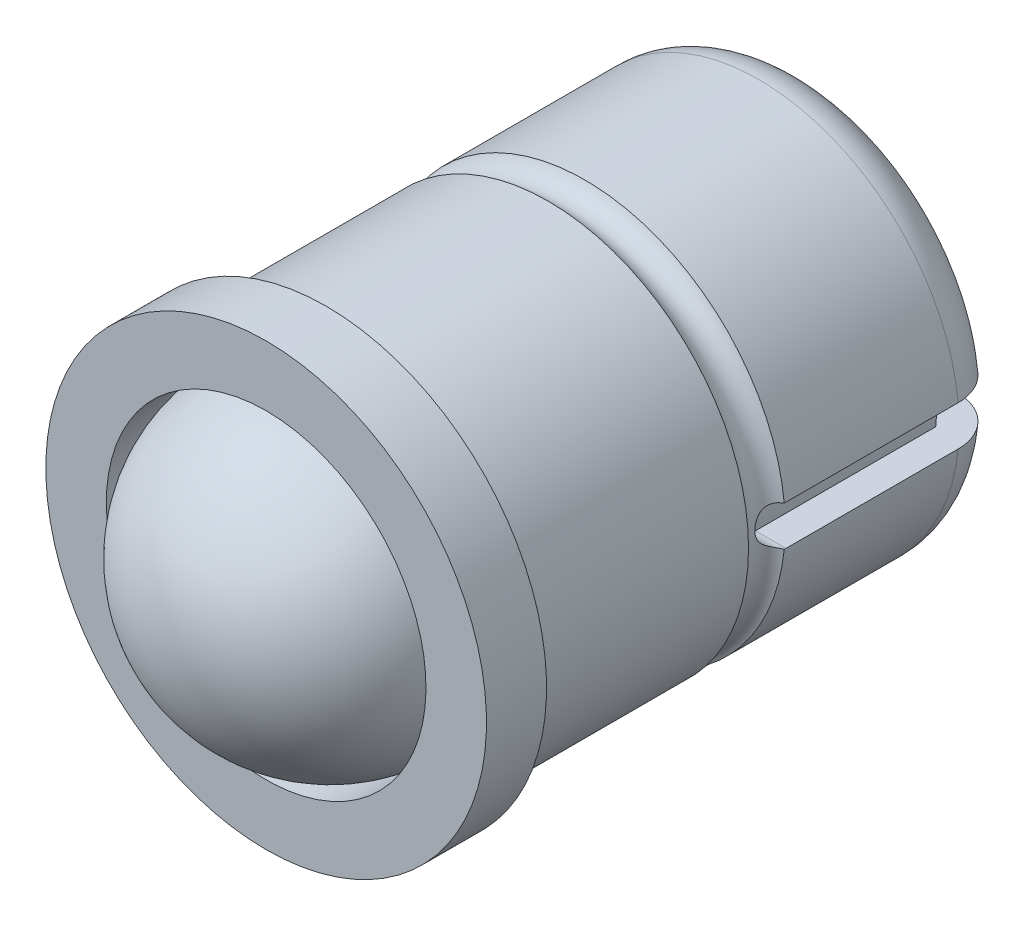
ISO-10303-21;
HEADER;
FILE_DESCRIPTION(('STEP AP214'),'2;1');
FILE_NAME('part.step','',(''),(''),'','','');
FILE_SCHEMA(('AUTOMOTIVE_DESIGN { 1 0 10303 214 1 1 1 1 }'));
ENDSEC;
DATA;
#1=APPLICATION_CONTEXT('core data for automotive mechanical design processes');
#2=APPLICATION_PROTOCOL_DEFINITION('international standard','automotive_design',2000,#1);
#3=PRODUCT_CONTEXT('',#1,'mechanical');
#4=PRODUCT('Part','Part','',(#3));
#5=PRODUCT_RELATED_PRODUCT_CATEGORY('part','',(#4));
#6=PRODUCT_DEFINITION_FORMATION('','',#4);
#7=PRODUCT_DEFINITION_CONTEXT('part definition',#1,'design');
#8=PRODUCT_DEFINITION('design','',#6,#7);
#9=PRODUCT_DEFINITION_SHAPE('','',#8);
#10=(LENGTH_UNIT() NAMED_UNIT(*) SI_UNIT(.MILLI.,.METRE.));
#11=(NAMED_UNIT(*) PLANE_ANGLE_UNIT() SI_UNIT($,.RADIAN.));
#12=(NAMED_UNIT(*) SI_UNIT($,.STERADIAN.) SOLID_ANGLE_UNIT());
#13=UNCERTAINTY_MEASURE_WITH_UNIT(LENGTH_MEASURE(1.E-05),#10,'distance_accuracy_value','');
#14=(GEOMETRIC_REPRESENTATION_CONTEXT(3) GLOBAL_UNCERTAINTY_ASSIGNED_CONTEXT((#13)) GLOBAL_UNIT_ASSIGNED_CONTEXT((#10,
#11,#12)) REPRESENTATION_CONTEXT('',''));
#15=CARTESIAN_POINT('',(0.,0.,0.));
#16=DIRECTION('',(0.,0.,1.));
#17=DIRECTION('',(1.,0.,0.));
#18=AXIS2_PLACEMENT_3D('',#15,#16,#17);
#19=CARTESIAN_POINT('',(0.,0.,1.5));
#20=DIRECTION('',(0.,0.,-1.));
#21=DIRECTION('',(0.,1.,0.));
#22=AXIS2_PLACEMENT_3D('',#19,#20,#21);
#23=CYLINDRICAL_SURFACE('',#22,3.99);
#24=CARTESIAN_POINT('',(0.,0.,1.5));
#25=DIRECTION('',(0.,0.,-1.));
#26=DIRECTION('',(0.,1.,0.));
#27=AXIS2_PLACEMENT_3D('',#24,#25,#26);
#28=CIRCLE('',#27,3.99);
#29=CARTESIAN_POINT('',(0.,3.99,1.5));
#30=VERTEX_POINT('',#29);
#31=EDGE_CURVE('E130',#30,#30,#28,.F.);
#32=ORIENTED_EDGE('',*,*,#31,.T.);
#33=EDGE_LOOP('',(#32));
#34=FACE_BOUND('',#33,.T.);
#35=CARTESIAN_POINT('',(0.,0.,0.182665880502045));
#36=DIRECTION('',(0.,0.,-1.));
#37=DIRECTION('',(0.,1.,0.));
#38=AXIS2_PLACEMENT_3D('',#35,#36,#37);
#39=CIRCLE('',#38,3.99);
#40=CARTESIAN_POINT('',(0.,3.99,0.182665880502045));
#41=VERTEX_POINT('',#40);
#42=EDGE_CURVE('E125',#41,#41,#39,.F.);
#43=ORIENTED_EDGE('',*,*,#42,.F.);
#44=EDGE_LOOP('',(#43));
#45=FACE_BOUND('',#44,.T.);
#46=ADVANCED_FACE('F14',(#34,#45),#23,.F.);
#47=CARTESIAN_POINT('',(5.5,0.,1.5));
#48=DIRECTION('',(0.,0.,-1.));
#49=DIRECTION('',(0.,1.,0.));
#50=AXIS2_PLACEMENT_3D('',#47,#48,#49);
#51=PLANE('',#50);
#52=CARTESIAN_POINT('',(0.,0.,1.5));
#53=DIRECTION('',(0.,0.,-1.));
#54=DIRECTION('',(0.,1.,0.));
#55=AXIS2_PLACEMENT_3D('',#52,#53,#54);
#56=CIRCLE('',#55,5.5);
#57=CARTESIAN_POINT('',(0.,5.5,1.5));
#58=VERTEX_POINT('',#57);
#59=EDGE_CURVE('E133',#58,#58,#56,.T.);
#60=ORIENTED_EDGE('',*,*,#59,.F.);
#61=EDGE_LOOP('',(#60));
#62=FACE_BOUND('',#61,.T.);
#63=ORIENTED_EDGE('',*,*,#31,.F.);
#64=EDGE_LOOP('',(#63));
#65=FACE_BOUND('',#64,.T.);
#66=ADVANCED_FACE('F16',(#62,#65),#51,.F.);
#67=CARTESIAN_POINT('',(0.,0.,1.5));
#68=DIRECTION('',(0.,0.,-1.));
#69=DIRECTION('',(0.,1.,0.));
#70=AXIS2_PLACEMENT_3D('',#67,#68,#69);
#71=CYLINDRICAL_SURFACE('',#70,5.5);
#72=CARTESIAN_POINT('',(0.,0.,0.));
#73=DIRECTION('',(0.,0.,-1.));
#74=DIRECTION('',(0.,1.,0.));
#75=AXIS2_PLACEMENT_3D('',#72,#73,#74);
#76=CIRCLE('',#75,5.5);
#77=CARTESIAN_POINT('',(0.,5.5,0.));
#78=VERTEX_POINT('',#77);
#79=EDGE_CURVE('E137',#78,#78,#76,.F.);
#80=ORIENTED_EDGE('',*,*,#79,.T.);
#81=EDGE_LOOP('',(#80));
#82=FACE_BOUND('',#81,.T.);
#83=ORIENTED_EDGE('',*,*,#59,.T.);
#84=EDGE_LOOP('',(#83));
#85=FACE_BOUND('',#84,.T.);
#86=ADVANCED_FACE('F395',(#82,#85),#71,.T.);
#87=CARTESIAN_POINT('',(5.,0.,0.));
#88=DIRECTION('',(0.,0.,1.));
#89=DIRECTION('',(0.,-1.,0.));
#90=AXIS2_PLACEMENT_3D('',#87,#88,#89);
#91=PLANE('',#90);
#92=CARTESIAN_POINT('',(0.,0.,0.));
#93=DIRECTION('',(0.,0.,-1.));
#94=DIRECTION('',(0.,1.,0.));
#95=AXIS2_PLACEMENT_3D('',#92,#93,#94);
#96=CIRCLE('',#95,5.);
#97=CARTESIAN_POINT('',(0.,5.,0.));
#98=VERTEX_POINT('',#97);
#99=EDGE_CURVE('E140',#98,#98,#96,.T.);
#100=ORIENTED_EDGE('',*,*,#99,.F.);
#101=EDGE_LOOP('',(#100));
#102=FACE_BOUND('',#101,.T.);
#103=ORIENTED_EDGE('',*,*,#79,.F.);
#104=EDGE_LOOP('',(#103));
#105=FACE_BOUND('',#104,.T.);
#106=ADVANCED_FACE('F426',(#102,#105),#91,.F.);
#107=CARTESIAN_POINT('',(0.,0.,1.5));
#108=DIRECTION('',(0.,0.,-1.));
#109=DIRECTION('',(0.,1.,0.));
#110=AXIS2_PLACEMENT_3D('',#107,#108,#109);
#111=CYLINDRICAL_SURFACE('',#110,5.);
#112=CARTESIAN_POINT('',(0.,0.,-5.54174243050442));
#113=DIRECTION('',(0.,0.,1.));
#114=DIRECTION('',(0.,-1.,0.));
#115=AXIS2_PLACEMENT_3D('',#112,#113,#114);
#116=CIRCLE('',#115,5.);
#117=CARTESIAN_POINT('',(0.,-5.,-5.54174243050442));
#118=VERTEX_POINT('',#117);
#119=EDGE_CURVE('E324',#118,#118,#116,.T.);
#120=ORIENTED_EDGE('',*,*,#119,.T.);
#121=EDGE_LOOP('',(#120));
#122=FACE_BOUND('',#121,.T.);
#123=ORIENTED_EDGE('',*,*,#99,.T.);
#124=EDGE_LOOP('',(#123));
#125=FACE_BOUND('',#124,.T.);
#126=ADVANCED_FACE('F421',(#122,#125),#111,.T.);
#127=CARTESIAN_POINT('',(5.5,0.,-6.5));
#128=DIRECTION('',(1.,0.,0.));
#129=DIRECTION('',(0.,1.,0.));
#130=AXIS2_PLACEMENT_3D('',#127,#128,#129);
#131=CYLINDRICAL_SURFACE('',#130,0.5);
#132=DIRECTION('',(1.,0.,0.));
#133=VECTOR('',#132,1.);
#134=CARTESIAN_POINT('',(5.5,0.5,-6.5));
#135=LINE('',#134,#133);
#136=CARTESIAN_POINT('',(-4.21385012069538,0.5,-6.5));
#137=VERTEX_POINT('',#136);
#138=CARTESIAN_POINT('',(-4.9749371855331,0.5,-6.5));
#139=VERTEX_POINT('',#138);
#140=EDGE_CURVE('E151',#137,#139,#135,.F.);
#141=ORIENTED_EDGE('',*,*,#140,.F.);
#142=CARTESIAN_POINT('',(-4.21385012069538,0.5,-6.5));
#143=CARTESIAN_POINT('',(-4.21385050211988,0.49999880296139,-6.47201957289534));
#144=CARTESIAN_POINT('',(-4.21413181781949,0.49764336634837,-6.44402134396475));
#145=CARTESIAN_POINT('',(-4.2152263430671,0.488283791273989,-6.3888031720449));
#146=CARTESIAN_POINT('',(-4.21604011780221,0.481274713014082,-6.36158408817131));
#147=CARTESIAN_POINT('',(-4.2181061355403,0.462816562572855,-6.30873172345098));
#148=CARTESIAN_POINT('',(-4.21935809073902,0.451370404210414,-6.28309741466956));
#149=CARTESIAN_POINT('',(-4.22215905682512,0.42436905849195,-6.23411858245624));
#150=CARTESIAN_POINT('',(-4.22370801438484,0.408814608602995,-6.21077364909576));
#151=CARTESIAN_POINT('',(-4.22693711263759,0.373955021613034,-6.16691475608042));
#152=CARTESIAN_POINT('',(-4.22861780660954,0.354633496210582,-6.14641386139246));
#153=CARTESIAN_POINT('',(-4.23191601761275,0.312823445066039,-6.1089377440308));
#154=CARTESIAN_POINT('',(-4.23353353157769,0.290334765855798,-6.09196269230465));
#155=CARTESIAN_POINT('',(-4.23652874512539,0.242747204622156,-6.06197370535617));
#156=CARTESIAN_POINT('',(-4.23790572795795,0.217640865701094,-6.04897152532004));
#157=CARTESIAN_POINT('',(-4.24025866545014,0.165582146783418,-6.02737262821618));
#158=CARTESIAN_POINT('',(-4.24123463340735,0.138629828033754,-6.01877576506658));
#159=CARTESIAN_POINT('',(-4.24267168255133,0.0837774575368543,-6.00627038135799));
#160=CARTESIAN_POINT('',(-4.24313514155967,0.0558824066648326,-6.00234020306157));
#161=CARTESIAN_POINT('',(-4.24350306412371,-0.000174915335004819,-5.99921266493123));
#162=CARTESIAN_POINT('',(-4.24340754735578,-0.0283371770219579,-6.00001513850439));
#163=CARTESIAN_POINT('',(-4.24267021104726,-0.0839822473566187,-6.00631269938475));
#164=CARTESIAN_POINT('',(-4.24203110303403,-0.11146773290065,-6.01178449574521));
#165=CARTESIAN_POINT('',(-4.24028145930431,-0.165127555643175,-6.02722900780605));
#166=CARTESIAN_POINT('',(-4.23917091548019,-0.191301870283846,-6.03720180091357));
#167=CARTESIAN_POINT('',(-4.2365985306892,-0.241668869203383,-6.06139022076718));
#168=CARTESIAN_POINT('',(-4.2351358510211,-0.265856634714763,-6.07561599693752));
#169=CARTESIAN_POINT('',(-4.23202298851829,-0.31151027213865,-6.10789918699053));
#170=CARTESIAN_POINT('',(-4.23037279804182,-0.332976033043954,-6.12595675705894));
#171=CARTESIAN_POINT('',(-4.22705791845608,-0.372713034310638,-6.16552156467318));
#172=CARTESIAN_POINT('',(-4.22539320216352,-0.390964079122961,-6.18704908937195));
#173=CARTESIAN_POINT('',(-4.22224681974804,-0.423596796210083,-6.23287282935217));
#174=CARTESIAN_POINT('',(-4.22076515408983,-0.437978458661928,-6.25716905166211));
#175=CARTESIAN_POINT('',(-4.21815261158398,-0.462464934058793,-6.30785773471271));
#176=CARTESIAN_POINT('',(-4.21702185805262,-0.472568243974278,-6.33425092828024));
#177=CARTESIAN_POINT('',(-4.21524162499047,-0.488193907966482,-6.38837551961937));
#178=CARTESIAN_POINT('',(-4.2145921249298,-0.493716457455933,-6.41610686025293));
#179=CARTESIAN_POINT('',(-4.21385163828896,-0.499997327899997,-6.47194252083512));
#180=CARTESIAN_POINT('',(-4.21375732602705,-0.500784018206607,-6.50004360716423));
#181=CARTESIAN_POINT('',(-4.21412910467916,-0.497645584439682,-6.55597717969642));
#182=CARTESIAN_POINT('',(-4.21459518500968,-0.49372054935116,-6.58380967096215));
#183=CARTESIAN_POINT('',(-4.21603220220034,-0.481293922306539,-6.63833169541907));
#184=CARTESIAN_POINT('',(-4.21700163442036,-0.472805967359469,-6.66502437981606));
#185=CARTESIAN_POINT('',(-4.21933490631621,-0.45150844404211,-6.71660747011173));
#186=CARTESIAN_POINT('',(-4.22069875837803,-0.438698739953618,-6.7414978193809));
#187=CARTESIAN_POINT('',(-4.22367519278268,-0.409051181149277,-6.78889834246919));
#188=CARTESIAN_POINT('',(-4.22528891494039,-0.392194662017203,-6.81139676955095));
#189=CARTESIAN_POINT('',(-4.22857964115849,-0.354958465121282,-6.85325517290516));
#190=CARTESIAN_POINT('',(-4.23025664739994,-0.334578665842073,-6.87261504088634));
#191=CARTESIAN_POINT('',(-4.23349514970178,-0.290750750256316,-6.90774586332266));
#192=CARTESIAN_POINT('',(-4.23505602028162,-0.267287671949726,-6.9234982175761));
#193=CARTESIAN_POINT('',(-4.23787711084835,-0.218032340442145,-6.95083837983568));
#194=CARTESIAN_POINT('',(-4.23913733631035,-0.192240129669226,-6.96242626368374));
#195=CARTESIAN_POINT('',(-4.24121235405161,-0.139121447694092,-6.98107758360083));
#196=CARTESIAN_POINT('',(-4.24202821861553,-0.111798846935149,-6.98815191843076));
#197=CARTESIAN_POINT('',(-4.2431270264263,-0.0563434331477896,-6.99761081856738));
#198=CARTESIAN_POINT('',(-4.24340999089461,-0.0282106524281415,-6.9999955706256));
#199=CARTESIAN_POINT('',(-4.24341104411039,0.0278845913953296,-7.00000439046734));
#200=CARTESIAN_POINT('',(-4.24313254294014,0.0558470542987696,-6.99765719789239));
#201=CARTESIAN_POINT('',(-4.24204871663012,0.110977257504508,-6.98832943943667));
#202=CARTESIAN_POINT('',(-4.24124339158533,0.138144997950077,-6.98134887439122));
#203=CARTESIAN_POINT('',(-4.23919603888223,0.190911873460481,-6.96296123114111));
#204=CARTESIAN_POINT('',(-4.23795413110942,0.216511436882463,-6.95155536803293));
#205=CARTESIAN_POINT('',(-4.23517141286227,0.265437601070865,-6.92464388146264));
#206=CARTESIAN_POINT('',(-4.23363060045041,0.28876418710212,-6.90913823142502));
#207=CARTESIAN_POINT('',(-4.23041107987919,0.332629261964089,-6.87436046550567));
#208=CARTESIAN_POINT('',(-4.22873162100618,0.353150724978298,-6.85506694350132));
#209=CARTESIAN_POINT('',(-4.22543022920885,0.390676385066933,-6.81330513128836));
#210=CARTESIAN_POINT('',(-4.22380831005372,0.407679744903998,-6.79083608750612));
#211=CARTESIAN_POINT('',(-4.22079968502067,0.437735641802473,-6.74327329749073));
#212=CARTESIAN_POINT('',(-4.21941380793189,0.45077437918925,-6.71817078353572));
#213=CARTESIAN_POINT('',(-4.21704392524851,0.472433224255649,-6.66613082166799));
#214=CARTESIAN_POINT('',(-4.21605947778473,0.481058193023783,-6.63919542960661));
#215=CARTESIAN_POINT('',(-4.21484582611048,0.491553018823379,-6.59343034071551));
#216=CARTESIAN_POINT('',(-4.21447426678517,0.494716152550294,-6.5748906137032));
#217=CARTESIAN_POINT('',(-4.21397628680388,0.498940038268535,-6.53756993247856));
#218=CARTESIAN_POINT('',(-4.21384986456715,0.50000080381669,-6.51878897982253));
#219=CARTESIAN_POINT('',(-4.21385012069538,0.5,-6.5));
#220=B_SPLINE_CURVE_WITH_KNOTS('',3,(#142,#143,#144,#145,#146,#147,#148,#149,#150,#151,#152,
#153,#154,#155,#156,#157,#158,#159,#160,#161,#162,#163,#164,#165,#166,#167,#168,#169,#170,#171,
#172,#173,#174,#175,#176,#177,#178,#179,#180,#181,#182,#183,#184,#185,#186,#187,#188,#189,#190,
#191,#192,#193,#194,#195,#196,#197,#198,#199,#200,#201,#202,#203,#204,#205,#206,#207,#208,#209,
#210,#211,#212,#213,#214,#215,#216,#217,#218,#219),.UNSPECIFIED.,.T.,.F.,(4,2,2,2,2,2,2,2,2,2,2,
2,2,2,2,2,2,2,2,2,2,2,2,2,2,2,2,2,2,2,2,2,2,2,2,2,2,2,4),(0.,0.0838726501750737,
0.167834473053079,0.251741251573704,0.335632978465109,0.419898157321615,0.504167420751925,
0.588683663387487,0.673197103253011,0.757316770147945,0.841433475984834,0.925133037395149,
1.00883403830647,1.09273640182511,1.17664218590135,1.26105761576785,1.34547325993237,
1.42991853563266,1.51436020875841,1.59829554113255,1.68222928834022,1.76591356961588,
1.84960047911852,1.93368103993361,2.01776450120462,2.10227219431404,2.1867783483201,
2.27107966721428,2.35537762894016,2.43916514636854,2.52295264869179,2.60671716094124,
2.69048221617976,2.77473502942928,2.85900787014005,2.94357076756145,3.02804033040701,
3.08436154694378,3.14068240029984),.UNSPECIFIED.);
#221=CARTESIAN_POINT('',(-4.21385012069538,-0.5,-6.5));
#222=VERTEX_POINT('',#221);
#223=EDGE_CURVE('E360',#137,#222,#220,.T.);
#224=ORIENTED_EDGE('',*,*,#223,.T.);
#225=DIRECTION('',(1.,0.,0.));
#226=VECTOR('',#225,1.);
#227=CARTESIAN_POINT('',(5.5,-0.5,-6.5));
#228=LINE('',#227,#226);
#229=CARTESIAN_POINT('',(-4.9749371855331,-0.5,-6.5));
#230=VERTEX_POINT('',#229);
#231=EDGE_CURVE('E143',#230,#222,#228,.T.);
#232=ORIENTED_EDGE('',*,*,#231,.F.);
#233=CARTESIAN_POINT('',(-4.97511230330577,-0.498254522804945,-6.45825756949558));
#234=CARTESIAN_POINT('',(-4.97505398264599,-0.498836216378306,-6.46520235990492));
#235=CARTESIAN_POINT('',(-4.97501022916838,-0.499272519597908,-6.47215329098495));
#236=CARTESIAN_POINT('',(-4.97495185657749,-0.499854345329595,-6.48606743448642));
#237=CARTESIAN_POINT('',(-4.97493723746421,-0.499999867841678,-6.49303064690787));
#238=CARTESIAN_POINT('',(-4.9749371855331,-0.5,-6.5));
#239=B_SPLINE_CURVE_WITH_KNOTS('',3,(#233,#234,#235,#236,#237,#238),.UNSPECIFIED.,.F.,.F.,(4,2,
4),(0.,0.0208942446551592,0.0417884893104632),.UNSPECIFIED.);
#240=CARTESIAN_POINT('',(-4.97511230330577,-0.498254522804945,-6.45825756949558));
#241=VERTEX_POINT('',#240);
#242=EDGE_CURVE('E295',#241,#230,#239,.T.);
#243=ORIENTED_EDGE('',*,*,#242,.F.);
#244=CARTESIAN_POINT('',(-4.97511230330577,-0.498254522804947,-6.45825756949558));
#245=CARTESIAN_POINT('',(-4.95347695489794,-0.497446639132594,-6.4488552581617));
#246=CARTESIAN_POINT('',(-4.93250433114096,-0.49627599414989,-6.43785192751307));
#247=CARTESIAN_POINT('',(-4.89232653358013,-0.49252672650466,-6.41291918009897));
#248=CARTESIAN_POINT('',(-4.87313419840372,-0.489938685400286,-6.3989705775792));
#249=CARTESIAN_POINT('',(-4.83717243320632,-0.482645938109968,-6.36848022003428));
#250=CARTESIAN_POINT('',(-4.82041612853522,-0.477930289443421,-6.35192535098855));
#251=CARTESIAN_POINT('',(-4.79012213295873,-0.465706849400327,-6.31709282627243));
#252=CARTESIAN_POINT('',(-4.77657185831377,-0.458210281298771,-6.2988223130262));
#253=CARTESIAN_POINT('',(-4.75417837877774,-0.440916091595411,-6.26348359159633));
#254=CARTESIAN_POINT('',(-4.74499994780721,-0.431423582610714,-6.24647788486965));
#255=CARTESIAN_POINT('',(-4.72945565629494,-0.409803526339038,-6.2128401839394));
#256=CARTESIAN_POINT('',(-4.72309252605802,-0.39767343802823,-6.19620856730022));
#257=CARTESIAN_POINT('',(-4.71311286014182,-0.371719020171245,-6.1650141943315));
#258=CARTESIAN_POINT('',(-4.70936955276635,-0.358017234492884,-6.15038864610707));
#259=CARTESIAN_POINT('',(-4.70362880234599,-0.328736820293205,-6.12272149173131));
#260=CARTESIAN_POINT('',(-4.70163488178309,-0.313154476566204,-6.10968312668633));
#261=CARTESIAN_POINT('',(-4.69869950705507,-0.278218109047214,-6.08391366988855));
#262=CARTESIAN_POINT('',(-4.69793877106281,-0.258639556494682,-6.07146722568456));
#263=CARTESIAN_POINT('',(-4.69731348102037,-0.217964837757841,-6.04941489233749));
#264=CARTESIAN_POINT('',(-4.69744824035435,-0.196869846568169,-6.03980683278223));
#265=CARTESIAN_POINT('',(-4.69807948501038,-0.149990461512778,-6.02226878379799));
#266=CARTESIAN_POINT('',(-4.69863175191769,-0.124004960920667,-6.01487367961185));
#267=CARTESIAN_POINT('',(-4.69952658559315,-0.0711812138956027,-6.0043601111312));
#268=CARTESIAN_POINT('',(-4.69986913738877,-0.0443429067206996,-6.00124195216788));
#269=CARTESIAN_POINT('',(-4.70007065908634,0.0106428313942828,-5.99932541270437));
#270=CARTESIAN_POINT('',(-4.69990835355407,0.0387972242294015,-6.00071718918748));
#271=CARTESIAN_POINT('',(-4.69918655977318,0.0944805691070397,-6.00820409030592));
#272=CARTESIAN_POINT('',(-4.69862686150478,0.122009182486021,-6.01430170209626));
#273=CARTESIAN_POINT('',(-4.6976876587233,0.175640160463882,-6.03102302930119));
#274=CARTESIAN_POINT('',(-4.69730804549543,0.201743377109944,-6.04164400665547));
#275=CARTESIAN_POINT('',(-4.69768343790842,0.25178972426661,-6.06711655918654));
#276=CARTESIAN_POINT('',(-4.69843754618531,0.275734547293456,-6.08196478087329));
#277=CARTESIAN_POINT('',(-4.70194798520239,0.316333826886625,-6.11212949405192));
#278=CARTESIAN_POINT('',(-4.70428927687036,0.333502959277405,-6.12680112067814));
#279=CARTESIAN_POINT('',(-4.71123230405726,0.365479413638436,-6.15805997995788));
#280=CARTESIAN_POINT('',(-4.71583170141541,0.380289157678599,-6.17464521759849));
#281=CARTESIAN_POINT('',(-4.72794667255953,0.407254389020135,-6.20909576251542));
#282=CARTESIAN_POINT('',(-4.73548198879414,0.419391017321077,-6.22696905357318));
#283=CARTESIAN_POINT('',(-4.75378669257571,0.44066382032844,-6.26282934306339));
#284=CARTESIAN_POINT('',(-4.76455322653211,0.449802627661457,-6.28081622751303));
#285=CARTESIAN_POINT('',(-4.78786399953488,0.464391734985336,-6.3139028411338));
#286=CARTESIAN_POINT('',(-4.80008573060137,0.470135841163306,-6.32910336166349));
#287=CARTESIAN_POINT('',(-4.82675047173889,0.479700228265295,-6.35814842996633));
#288=CARTESIAN_POINT('',(-4.84119847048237,0.483516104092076,-6.37198981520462));
#289=CARTESIAN_POINT('',(-4.87430620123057,0.490108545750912,-6.39984380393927));
#290=CARTESIAN_POINT('',(-4.89327161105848,0.492632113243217,-6.41354998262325));
#291=CARTESIAN_POINT('',(-4.9329860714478,0.496303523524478,-6.43810463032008));
#292=CARTESIAN_POINT('',(-4.95372717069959,0.497457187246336,-6.44896503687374));
#293=CARTESIAN_POINT('',(-4.97511230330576,0.49825452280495,-6.45825756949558));
#294=B_SPLINE_CURVE_WITH_KNOTS('',3,(#244,#245,#246,#247,#248,#249,#250,#251,#252,#253,#254,
#255,#256,#257,#258,#259,#260,#261,#262,#263,#264,#265,#266,#267,#268,#269,#270,#271,#272,#273,
#274,#275,#276,#277,#278,#279,#280,#281,#282,#283,#284,#285,#286,#287,#288,#289,#290,#291,#292,
#293),.UNSPECIFIED.,.F.,.F.,(4,2,2,2,2,2,2,2,2,2,2,2,2,2,2,2,2,2,2,2,2,2,2,2,4),(0.,
0.0708172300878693,0.142110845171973,0.213775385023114,0.285153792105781,0.349393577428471,
0.413695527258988,0.47461810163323,0.53566306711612,0.605037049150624,0.674357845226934,
0.755065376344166,0.835778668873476,0.919938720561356,1.00414328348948,1.08829694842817,
1.17238403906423,1.24022324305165,1.30799235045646,1.37622525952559,1.44439808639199,
1.50512651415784,1.56599305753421,1.63630018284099,1.70630748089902),.UNSPECIFIED.);
#295=CARTESIAN_POINT('',(-4.97511230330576,0.498254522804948,-6.45825756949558));
#296=VERTEX_POINT('',#295);
#297=EDGE_CURVE('E318',#241,#296,#294,.T.);
#298=ORIENTED_EDGE('',*,*,#297,.T.);
#299=CARTESIAN_POINT('',(-4.9749371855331,0.5,-6.5));
#300=CARTESIAN_POINT('',(-4.97493723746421,0.499999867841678,-6.49303064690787));
#301=CARTESIAN_POINT('',(-4.97495185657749,0.499854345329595,-6.48606743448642));
#302=CARTESIAN_POINT('',(-4.97501022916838,0.499272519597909,-6.47215329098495));
#303=CARTESIAN_POINT('',(-4.97505398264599,0.498836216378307,-6.46520235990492));
#304=CARTESIAN_POINT('',(-4.97511230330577,0.498254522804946,-6.45825756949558));
#305=B_SPLINE_CURVE_WITH_KNOTS('',3,(#299,#300,#301,#302,#303,#304),.UNSPECIFIED.,.F.,.F.,(4,2,
4),(0.,0.0208942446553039,0.0417884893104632),.UNSPECIFIED.);
#306=EDGE_CURVE('E113',#139,#296,#305,.T.);
#307=ORIENTED_EDGE('',*,*,#306,.F.);
#308=EDGE_LOOP('',(#141,#224,#232,#243,#298,#307));
#309=FACE_BOUND('',#308,.T.);
#310=ADVANCED_FACE('F159',(#309),#131,.F.);
#311=CARTESIAN_POINT('',(5.5,0.,-6.5));
#312=DIRECTION('',(1.,0.,0.));
#313=DIRECTION('',(0.,1.,0.));
#314=AXIS2_PLACEMENT_3D('',#311,#312,#313);
#315=CYLINDRICAL_SURFACE('',#314,0.5);
#316=DIRECTION('',(1.,0.,0.));
#317=VECTOR('',#316,1.);
#318=CARTESIAN_POINT('',(5.5,-0.5,-6.5));
#319=LINE('',#318,#317);
#320=CARTESIAN_POINT('',(4.21385012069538,-0.5,-6.5));
#321=VERTEX_POINT('',#320);
#322=CARTESIAN_POINT('',(4.9749371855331,-0.5,-6.5));
#323=VERTEX_POINT('',#322);
#324=EDGE_CURVE('E112',#321,#323,#319,.T.);
#325=ORIENTED_EDGE('',*,*,#324,.F.);
#326=CARTESIAN_POINT('',(4.21385012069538,-0.5,-6.5));
#327=CARTESIAN_POINT('',(4.21383926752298,-0.500024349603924,-6.47197459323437));
#328=CARTESIAN_POINT('',(4.2141294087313,-0.49764523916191,-6.44395853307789));
#329=CARTESIAN_POINT('',(4.21523104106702,-0.488262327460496,-6.38875044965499));
#330=CARTESIAN_POINT('',(4.21604199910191,-0.481263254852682,-6.36155761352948));
#331=CARTESIAN_POINT('',(4.2181052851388,-0.462818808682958,-6.3087318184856));
#332=CARTESIAN_POINT('',(4.21935776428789,-0.451371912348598,-6.28309939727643));
#333=CARTESIAN_POINT('',(4.22215913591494,-0.424369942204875,-6.23412093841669));
#334=CARTESIAN_POINT('',(4.22370800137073,-0.408815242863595,-6.21077469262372));
#335=CARTESIAN_POINT('',(4.22693697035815,-0.373956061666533,-6.16691581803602));
#336=CARTESIAN_POINT('',(4.22861761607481,-0.354635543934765,-6.14641597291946));
#337=CARTESIAN_POINT('',(4.23191586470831,-0.312825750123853,-6.10893953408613));
#338=CARTESIAN_POINT('',(4.23353345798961,-0.290335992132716,-6.09196347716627));
#339=CARTESIAN_POINT('',(4.23652878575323,-0.242746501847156,-6.06197325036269));
#340=CARTESIAN_POINT('',(4.23790580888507,-0.217639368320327,-6.0489707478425));
#341=CARTESIAN_POINT('',(4.24025872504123,-0.165580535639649,-6.0273721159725));
#342=CARTESIAN_POINT('',(4.24123465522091,-0.13862900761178,-6.01877557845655));
#343=CARTESIAN_POINT('',(4.24267167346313,-0.0837777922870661,-6.00627045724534));
#344=CARTESIAN_POINT('',(4.24313513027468,-0.0558830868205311,-6.00234029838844));
#345=CARTESIAN_POINT('',(4.24350306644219,0.00017422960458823,-5.99921264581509));
#346=CARTESIAN_POINT('',(4.24340755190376,0.0283368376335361,-6.00001510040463));
#347=CARTESIAN_POINT('',(4.24267021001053,0.0839823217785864,-6.0063127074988));
#348=CARTESIAN_POINT('',(4.24203109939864,0.11146787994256,-6.01178452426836));
#349=CARTESIAN_POINT('',(4.2402814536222,0.16512769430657,-6.02722906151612));
#350=CARTESIAN_POINT('',(4.23917091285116,0.191301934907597,-6.03720183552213));
#351=CARTESIAN_POINT('',(4.23659850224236,0.241669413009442,-6.06139047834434));
#352=CARTESIAN_POINT('',(4.23513578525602,0.265857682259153,-6.07561659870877));
#353=CARTESIAN_POINT('',(4.23202292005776,0.311511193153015,-6.1078999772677));
#354=CARTESIAN_POINT('',(4.23037277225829,0.332976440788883,-6.12595722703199));
#355=CARTESIAN_POINT('',(4.22705815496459,0.372710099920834,-6.16551857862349));
#356=CARTESIAN_POINT('',(4.22539365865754,0.390958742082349,-6.18704253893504));
#357=CARTESIAN_POINT('',(4.22224729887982,0.423592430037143,-6.23286575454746));
#358=CARTESIAN_POINT('',(4.22076549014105,0.437976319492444,-6.25716583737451));
#359=CARTESIAN_POINT('',(4.21815150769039,0.462474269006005,-6.30787584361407));
#360=CARTESIAN_POINT('',(4.21701966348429,0.472584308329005,-6.33428772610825));
#361=CARTESIAN_POINT('',(4.21524119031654,0.488200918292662,-6.38841864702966));
#362=CARTESIAN_POINT('',(4.2145938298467,0.493714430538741,-6.41613564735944));
#363=CARTESIAN_POINT('',(4.21397326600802,0.498957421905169,-6.46266691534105));
#364=CARTESIAN_POINT('',(4.21384649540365,0.500009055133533,-6.48133786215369));
#365=CARTESIAN_POINT('',(4.21385012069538,0.5,-6.5));
#366=B_SPLINE_CURVE_WITH_KNOTS('',3,(#326,#327,#328,#329,#330,#331,#332,#333,#334,#335,#336,
#337,#338,#339,#340,#341,#342,#343,#344,#345,#346,#347,#348,#349,#350,#351,#352,#353,#354,#355,
#356,#357,#358,#359,#360,#361,#362,#363,#364,#365),.UNSPECIFIED.,.F.,.F.,(4,2,2,2,2,2,2,2,2,2,2,
2,2,2,2,2,2,2,2,4),(0.,0.0839601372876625,0.167834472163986,0.251737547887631,0.33563297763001,
0.419893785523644,0.504167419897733,0.588686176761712,0.673197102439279,0.757315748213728,
0.84143347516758,0.925133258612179,1.00883403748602,1.09273820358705,1.17664218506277,
1.26104510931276,1.3454732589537,1.42998066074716,1.51436020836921,1.57034056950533),.UNSPECIFIED.);
#367=CARTESIAN_POINT('',(4.21385012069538,0.5,-6.5));
#368=VERTEX_POINT('',#367);
#369=EDGE_CURVE('E117',#321,#368,#366,.T.);
#370=ORIENTED_EDGE('',*,*,#369,.T.);
#371=DIRECTION('',(1.,0.,0.));
#372=VECTOR('',#371,1.);
#373=CARTESIAN_POINT('',(5.5,0.5,-6.5));
#374=LINE('',#373,#372);
#375=CARTESIAN_POINT('',(4.9749371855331,0.5,-6.5));
#376=VERTEX_POINT('',#375);
#377=EDGE_CURVE('E102',#376,#368,#374,.F.);
#378=ORIENTED_EDGE('',*,*,#377,.F.);
#379=CARTESIAN_POINT('',(4.97511230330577,0.498254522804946,-6.45825756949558));
#380=CARTESIAN_POINT('',(4.97505398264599,0.498836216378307,-6.46520235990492));
#381=CARTESIAN_POINT('',(4.97501022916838,0.499272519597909,-6.47215329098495));
#382=CARTESIAN_POINT('',(4.97495185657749,0.499854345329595,-6.48606743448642));
#383=CARTESIAN_POINT('',(4.97493723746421,0.499999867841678,-6.49303064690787));
#384=CARTESIAN_POINT('',(4.9749371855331,0.5,-6.5));
#385=B_SPLINE_CURVE_WITH_KNOTS('',3,(#379,#380,#381,#382,#383,#384),.UNSPECIFIED.,.F.,.F.,(4,2,
4),(0.,0.0208942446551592,0.0417884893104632),.UNSPECIFIED.);
#386=CARTESIAN_POINT('',(4.97511230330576,0.498254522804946,-6.45825756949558));
#387=VERTEX_POINT('',#386);
#388=EDGE_CURVE('E152',#387,#376,#385,.T.);
#389=ORIENTED_EDGE('',*,*,#388,.F.);
#390=CARTESIAN_POINT('',(4.97511230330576,0.498254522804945,-6.45825756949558));
#391=CARTESIAN_POINT('',(4.95347695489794,0.497446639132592,-6.4488552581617));
#392=CARTESIAN_POINT('',(4.93250433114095,0.496275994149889,-6.43785192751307));
#393=CARTESIAN_POINT('',(4.89232653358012,0.492526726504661,-6.41291918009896));
#394=CARTESIAN_POINT('',(4.87313419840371,0.489938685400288,-6.39897057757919));
#395=CARTESIAN_POINT('',(4.83717243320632,0.482645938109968,-6.36848022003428));
#396=CARTESIAN_POINT('',(4.82041612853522,0.47793028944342,-6.35192535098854));
#397=CARTESIAN_POINT('',(4.79012213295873,0.465706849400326,-6.31709282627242));
#398=CARTESIAN_POINT('',(4.77657185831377,0.458210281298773,-6.2988223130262));
#399=CARTESIAN_POINT('',(4.75417837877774,0.440916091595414,-6.26348359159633));
#400=CARTESIAN_POINT('',(4.74499994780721,0.431423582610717,-6.24647788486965));
#401=CARTESIAN_POINT('',(4.72945565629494,0.409803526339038,-6.2128401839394));
#402=CARTESIAN_POINT('',(4.72309252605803,0.397673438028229,-6.19620856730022));
#403=CARTESIAN_POINT('',(4.71311286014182,0.371719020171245,-6.1650141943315));
#404=CARTESIAN_POINT('',(4.70936955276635,0.358017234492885,-6.15038864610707));
#405=CARTESIAN_POINT('',(4.70362880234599,0.328736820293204,-6.12272149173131));
#406=CARTESIAN_POINT('',(4.70163488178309,0.313154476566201,-6.10968312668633));
#407=CARTESIAN_POINT('',(4.69869950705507,0.27821810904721,-6.08391366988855));
#408=CARTESIAN_POINT('',(4.69793877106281,0.258639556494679,-6.07146722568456));
#409=CARTESIAN_POINT('',(4.69731348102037,0.217964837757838,-6.04941489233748));
#410=CARTESIAN_POINT('',(4.69744824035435,0.196869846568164,-6.03980683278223));
#411=CARTESIAN_POINT('',(4.69807948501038,0.149990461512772,-6.02226878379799));
#412=CARTESIAN_POINT('',(4.69863175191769,0.124004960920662,-6.01487367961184));
#413=CARTESIAN_POINT('',(4.69952658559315,0.0711812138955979,-6.0043601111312));
#414=CARTESIAN_POINT('',(4.69986913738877,0.0443429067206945,-6.00124195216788));
#415=CARTESIAN_POINT('',(4.70007065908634,-0.0106428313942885,-5.99932541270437));
#416=CARTESIAN_POINT('',(4.69990835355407,-0.0387972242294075,-6.00071718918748));
#417=CARTESIAN_POINT('',(4.69918655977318,-0.0944805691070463,-6.00820409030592));
#418=CARTESIAN_POINT('',(4.69862686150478,-0.122009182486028,-6.01430170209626));
#419=CARTESIAN_POINT('',(4.6976876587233,-0.175640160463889,-6.03102302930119));
#420=CARTESIAN_POINT('',(4.69730804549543,-0.201743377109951,-6.04164400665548));
#421=CARTESIAN_POINT('',(4.69768343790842,-0.251789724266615,-6.06711655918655));
#422=CARTESIAN_POINT('',(4.69843754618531,-0.275734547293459,-6.0819647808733));
#423=CARTESIAN_POINT('',(4.70194798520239,-0.316333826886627,-6.11212949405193));
#424=CARTESIAN_POINT('',(4.70428927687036,-0.333502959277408,-6.12680112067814));
#425=CARTESIAN_POINT('',(4.71123230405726,-0.36547941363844,-6.15805997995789));
#426=CARTESIAN_POINT('',(4.71583170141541,-0.380289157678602,-6.17464521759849));
#427=CARTESIAN_POINT('',(4.72794667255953,-0.407254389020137,-6.20909576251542));
#428=CARTESIAN_POINT('',(4.73548198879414,-0.419391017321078,-6.22696905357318));
#429=CARTESIAN_POINT('',(4.75378669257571,-0.440663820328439,-6.26282934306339));
#430=CARTESIAN_POINT('',(4.76455322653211,-0.449802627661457,-6.28081622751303));
#431=CARTESIAN_POINT('',(4.78786399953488,-0.464391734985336,-6.3139028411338));
#432=CARTESIAN_POINT('',(4.80008573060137,-0.470135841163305,-6.32910336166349));
#433=CARTESIAN_POINT('',(4.82675047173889,-0.479700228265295,-6.35814842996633));
#434=CARTESIAN_POINT('',(4.84119847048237,-0.483516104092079,-6.37198981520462));
#435=CARTESIAN_POINT('',(4.87430620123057,-0.490108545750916,-6.39984380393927));
#436=CARTESIAN_POINT('',(4.89327161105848,-0.492632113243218,-6.41354998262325));
#437=CARTESIAN_POINT('',(4.9329860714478,-0.496303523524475,-6.43810463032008));
#438=CARTESIAN_POINT('',(4.95372717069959,-0.49745718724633,-6.44896503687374));
#439=CARTESIAN_POINT('',(4.97511230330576,-0.498254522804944,-6.45825756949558));
#440=B_SPLINE_CURVE_WITH_KNOTS('',3,(#390,#391,#392,#393,#394,#395,#396,#397,#398,#399,#400,
#401,#402,#403,#404,#405,#406,#407,#408,#409,#410,#411,#412,#413,#414,#415,#416,#417,#418,#419,
#420,#421,#422,#423,#424,#425,#426,#427,#428,#429,#430,#431,#432,#433,#434,#435,#436,#437,#438,
#439),.UNSPECIFIED.,.F.,.F.,(4,2,2,2,2,2,2,2,2,2,2,2,2,2,2,2,2,2,2,2,2,2,2,2,4),(0.,
0.070817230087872,0.142110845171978,0.213775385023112,0.285153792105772,0.349393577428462,
0.41369552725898,0.474618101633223,0.535663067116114,0.605037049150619,0.674357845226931,
0.755065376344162,0.835778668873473,0.919938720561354,1.00414328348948,1.08829694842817,
1.17238403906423,1.24022324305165,1.30799235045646,1.37622525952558,1.44439808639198,
1.50512651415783,1.56599305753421,1.63630018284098,1.70630748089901),.UNSPECIFIED.);
#441=CARTESIAN_POINT('',(4.97511230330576,-0.498254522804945,-6.45825756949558));
#442=VERTEX_POINT('',#441);
#443=EDGE_CURVE('E313',#387,#442,#440,.T.);
#444=ORIENTED_EDGE('',*,*,#443,.T.);
#445=CARTESIAN_POINT('',(4.9749371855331,-0.5,-6.5));
#446=CARTESIAN_POINT('',(4.97493723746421,-0.499999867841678,-6.49303064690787));
#447=CARTESIAN_POINT('',(4.97495185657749,-0.499854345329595,-6.48606743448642));
#448=CARTESIAN_POINT('',(4.97501022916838,-0.499272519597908,-6.47215329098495));
#449=CARTESIAN_POINT('',(4.97505398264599,-0.498836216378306,-6.46520235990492));
#450=CARTESIAN_POINT('',(4.97511230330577,-0.498254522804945,-6.45825756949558));
#451=B_SPLINE_CURVE_WITH_KNOTS('',3,(#445,#446,#447,#448,#449,#450),.UNSPECIFIED.,.F.,.F.,(4,2,
4),(0.,0.020894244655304,0.0417884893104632),.UNSPECIFIED.);
#452=EDGE_CURVE('E289',#323,#442,#451,.T.);
#453=ORIENTED_EDGE('',*,*,#452,.F.);
#454=EDGE_LOOP('',(#325,#370,#378,#389,#444,#453));
#455=FACE_BOUND('',#454,.T.);
#456=ADVANCED_FACE('F118',(#455),#315,.F.);
#457=CARTESIAN_POINT('',(0.,0.,-6.));
#458=DIRECTION('',(0.,0.,1.));
#459=DIRECTION('',(0.,-1.,0.));
#460=AXIS2_PLACEMENT_3D('',#457,#458,#459);
#461=TOROIDAL_SURFACE('',#460,5.2,0.5);
#462=CARTESIAN_POINT('',(0.,0.,-6.45825756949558));
#463=DIRECTION('',(0.,0.,-1.));
#464=DIRECTION('',(0.,1.,0.));
#465=AXIS2_PLACEMENT_3D('',#462,#463,#464);
#466=CIRCLE('',#465,5.);
#467=EDGE_CURVE('E243',#296,#387,#466,.T.);
#468=ORIENTED_EDGE('',*,*,#467,.F.);
#469=ORIENTED_EDGE('',*,*,#297,.F.);
#470=CARTESIAN_POINT('',(0.,0.,-6.45825756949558));
#471=DIRECTION('',(0.,0.,-1.));
#472=DIRECTION('',(0.,1.,0.));
#473=AXIS2_PLACEMENT_3D('',#470,#471,#472);
#474=CIRCLE('',#473,5.);
#475=EDGE_CURVE('E193',#442,#241,#474,.T.);
#476=ORIENTED_EDGE('',*,*,#475,.F.);
#477=ORIENTED_EDGE('',*,*,#443,.F.);
#478=EDGE_LOOP('',(#468,#469,#476,#477));
#479=FACE_BOUND('',#478,.T.);
#480=ORIENTED_EDGE('',*,*,#119,.F.);
#481=EDGE_LOOP('',(#480));
#482=FACE_BOUND('',#481,.T.);
#483=ADVANCED_FACE('F306',(#479,#482),#461,.F.);
#484=CARTESIAN_POINT('',(0.,0.,1.5));
#485=DIRECTION('',(0.,0.,-1.));
#486=DIRECTION('',(0.,1.,0.));
#487=AXIS2_PLACEMENT_3D('',#484,#485,#486);
#488=CYLINDRICAL_SURFACE('',#487,5.);
#489=ORIENTED_EDGE('',*,*,#452,.T.);
#490=ORIENTED_EDGE('',*,*,#475,.T.);
#491=ORIENTED_EDGE('',*,*,#242,.T.);
#492=DIRECTION('',(0.,0.,1.));
#493=VECTOR('',#492,1.);
#494=CARTESIAN_POINT('',(-4.9749371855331,-0.5,-6.5));
#495=LINE('',#494,#493);
#496=CARTESIAN_POINT('',(-4.9749371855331,-0.5,-10.8));
#497=VERTEX_POINT('',#496);
#498=EDGE_CURVE('E237',#497,#230,#495,.T.);
#499=ORIENTED_EDGE('',*,*,#498,.F.);
#500=CARTESIAN_POINT('',(0.,0.,-10.8));
#501=DIRECTION('',(0.,0.,1.));
#502=DIRECTION('',(0.,-1.,0.));
#503=AXIS2_PLACEMENT_3D('',#500,#501,#502);
#504=CIRCLE('',#503,5.);
#505=CARTESIAN_POINT('',(4.9749371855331,-0.5,-10.8));
#506=VERTEX_POINT('',#505);
#507=EDGE_CURVE('E190',#506,#497,#504,.F.);
#508=ORIENTED_EDGE('',*,*,#507,.F.);
#509=DIRECTION('',(0.,0.,1.));
#510=VECTOR('',#509,1.);
#511=CARTESIAN_POINT('',(4.9749371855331,-0.5,-6.5));
#512=LINE('',#511,#510);
#513=EDGE_CURVE('E282',#323,#506,#512,.F.);
#514=ORIENTED_EDGE('',*,*,#513,.F.);
#515=EDGE_LOOP('',(#489,#490,#491,#499,#508,#514));
#516=FACE_BOUND('',#515,.T.);
#517=ADVANCED_FACE('F303',(#516),#488,.T.);
#518=CARTESIAN_POINT('',(0.,0.,-12.));
#519=DIRECTION('',(0.,0.,1.));
#520=DIRECTION('',(0.,-1.,0.));
#521=AXIS2_PLACEMENT_3D('',#518,#519,#520);
#522=PLANE('',#521);
#523=CARTESIAN_POINT('',(0.,0.,-12.));
#524=DIRECTION('',(0.,0.,1.));
#525=DIRECTION('',(-0.991305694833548,-0.131578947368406,0.));
#526=AXIS2_PLACEMENT_3D('',#523,#524,#525);
#527=CIRCLE('',#526,3.80000000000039);
#528=CARTESIAN_POINT('',(-3.76696164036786,-0.5,-12.));
#529=VERTEX_POINT('',#528);
#530=CARTESIAN_POINT('',(3.76696164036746,-0.500000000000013,-12.));
#531=VERTEX_POINT('',#530);
#532=EDGE_CURVE('E192',#529,#531,#527,.T.);
#533=ORIENTED_EDGE('',*,*,#532,.F.);
#534=DIRECTION('',(1.,0.,0.));
#535=VECTOR('',#534,1.);
#536=CARTESIAN_POINT('',(5.5,-0.5,-12.));
#537=LINE('',#536,#535);
#538=EDGE_CURVE('E272',#531,#529,#537,.F.);
#539=ORIENTED_EDGE('',*,*,#538,.F.);
#540=EDGE_LOOP('',(#533,#539));
#541=FACE_BOUND('',#540,.T.);
#542=ADVANCED_FACE('F177',(#541),#522,.F.);
#543=CARTESIAN_POINT('',(0.,0.,-10.8));
#544=DIRECTION('',(0.,0.,1.));
#545=DIRECTION('',(0.,-1.,0.));
#546=AXIS2_PLACEMENT_3D('',#543,#544,#545);
#547=TOROIDAL_SURFACE('',#546,3.8,1.2);
#548=ORIENTED_EDGE('',*,*,#532,.T.);
#549=CARTESIAN_POINT('',(4.9749371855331,-0.5,-10.8));
#550=CARTESIAN_POINT('',(4.97493758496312,-0.5,-10.8336295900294));
#551=CARTESIAN_POINT('',(4.97351568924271,-0.5,-10.8672442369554));
#552=CARTESIAN_POINT('',(4.96784433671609,-0.5,-10.9342304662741));
#553=CARTESIAN_POINT('',(4.96359518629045,-0.5,-10.9676020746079));
#554=CARTESIAN_POINT('',(4.94665163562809,-0.5,-11.0669280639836));
#555=CARTESIAN_POINT('',(4.92976100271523,-0.5,-11.1322122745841));
#556=CARTESIAN_POINT('',(4.88524272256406,-0.5,-11.2590424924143));
#557=CARTESIAN_POINT('',(4.85761033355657,-0.5,-11.3205868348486));
#558=CARTESIAN_POINT('',(4.80877174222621,-0.5,-11.4087145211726));
#559=CARTESIAN_POINT('',(4.79125765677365,-0.5,-11.4373958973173));
#560=CARTESIAN_POINT('',(4.75386909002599,-0.5,-11.4932155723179));
#561=CARTESIAN_POINT('',(4.73399240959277,-0.5,-11.5203523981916));
#562=CARTESIAN_POINT('',(4.67099199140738,-0.5,-11.5991755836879));
#563=CARTESIAN_POINT('',(4.62451677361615,-0.5,-11.648240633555));
#564=CARTESIAN_POINT('',(4.52401515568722,-0.5,-11.7379050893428));
#565=CARTESIAN_POINT('',(4.46998852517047,-0.5,-11.7785042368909));
#566=CARTESIAN_POINT('',(4.3843423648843,-0.5,-11.8323101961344));
#567=CARTESIAN_POINT('',(4.35492522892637,-0.5,-11.8491052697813));
#568=CARTESIAN_POINT('',(4.29481735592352,-0.5,-11.8801581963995));
#569=CARTESIAN_POINT('',(4.26412778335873,-0.5,-11.8944183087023));
#570=CARTESIAN_POINT('',(4.17042654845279,-0.5,-11.9332594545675));
#571=CARTESIAN_POINT('',(4.10573075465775,-0.5,-11.9539336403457));
#572=CARTESIAN_POINT('',(3.99507660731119,-0.5,-11.9793646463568));
#573=CARTESIAN_POINT('',(3.94976817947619,-0.5,-11.9871004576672));
#574=CARTESIAN_POINT('',(3.85863548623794,-0.5,-11.9974162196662));
#575=CARTESIAN_POINT('',(3.81281207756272,-0.5,-12.0000037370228));
#576=CARTESIAN_POINT('',(3.76696164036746,-0.5,-12.));
#577=B_SPLINE_CURVE_WITH_KNOTS('',3,(#549,#550,#551,#552,#553,#554,#555,#556,#557,#558,#559,
#560,#561,#562,#563,#564,#565,#566,#567,#568,#569,#570,#571,#572,#573,#574,#575,#576),
.UNSPECIFIED.,.F.,.F.,(4,2,2,2,2,2,2,2,2,2,2,2,2,4),(0.,0.100829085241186,0.20164724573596,
0.402932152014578,0.604306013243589,0.705020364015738,0.805829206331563,1.00756214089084,
1.20930123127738,1.31081688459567,1.41224160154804,1.61491053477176,1.75253763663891,
1.889962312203),.UNSPECIFIED.);
#578=EDGE_CURVE('E279',#506,#531,#577,.T.);
#579=ORIENTED_EDGE('',*,*,#578,.F.);
#580=ORIENTED_EDGE('',*,*,#507,.T.);
#581=CARTESIAN_POINT('',(-3.76696164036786,-0.5,-12.));
#582=CARTESIAN_POINT('',(-3.80113721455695,-0.5,-12.0000002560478));
#583=CARTESIAN_POINT('',(-3.83529802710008,-0.5,-11.9985646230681));
#584=CARTESIAN_POINT('',(-3.90337644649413,-0.5,-11.992833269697));
#585=CARTESIAN_POINT('',(-3.93729406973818,-0.5,-11.9885377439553));
#586=CARTESIAN_POINT('',(-4.03827813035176,-0.5,-11.9713939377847));
#587=CARTESIAN_POINT('',(-4.10466872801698,-0.5,-11.9542883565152));
#588=CARTESIAN_POINT('',(-4.23366791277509,-0.5,-11.9091289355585));
#589=CARTESIAN_POINT('',(-4.29627401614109,-0.5,-11.881067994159));
#590=CARTESIAN_POINT('',(-4.38588818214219,-0.5,-11.8314064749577));
#591=CARTESIAN_POINT('',(-4.41504558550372,-0.5,-11.8135894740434));
#592=CARTESIAN_POINT('',(-4.4717746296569,-0.5,-11.7755315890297));
#593=CARTESIAN_POINT('',(-4.4993446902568,-0.5,-11.7552883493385));
#594=CARTESIAN_POINT('',(-4.57901080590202,-0.5,-11.6913904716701));
#595=CARTESIAN_POINT('',(-4.62845163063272,-0.5,-11.6443516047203));
#596=CARTESIAN_POINT('',(-4.71865900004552,-0.5,-11.5425877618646));
#597=CARTESIAN_POINT('',(-4.75942612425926,-0.5,-11.4878632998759));
#598=CARTESIAN_POINT('',(-4.81306574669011,-0.5,-11.4014073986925));
#599=CARTESIAN_POINT('',(-4.82966405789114,-0.5,-11.3719335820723));
#600=CARTESIAN_POINT('',(-4.86029707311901,-0.5,-11.3117186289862));
#601=CARTESIAN_POINT('',(-4.87433403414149,-0.5,-11.2809786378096));
#602=CARTESIAN_POINT('',(-4.91244908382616,-0.5,-11.1871483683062));
#603=CARTESIAN_POINT('',(-4.93257164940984,-0.499999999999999,-11.122382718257));
#604=CARTESIAN_POINT('',(-4.95633788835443,-0.500000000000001,-11.0143312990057));
#605=CARTESIAN_POINT('',(-4.96330833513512,-0.500000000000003,-10.9717353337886));
#606=CARTESIAN_POINT('',(-4.97260577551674,-0.499999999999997,-10.8861017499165));
#607=CARTESIAN_POINT('',(-4.97493944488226,-0.49999999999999,-10.8430648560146));
#608=CARTESIAN_POINT('',(-4.9749371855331,-0.499999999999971,-10.8));
#609=B_SPLINE_CURVE_WITH_KNOTS('',3,(#581,#582,#583,#584,#585,#586,#587,#588,#589,#590,#591,
#592,#593,#594,#595,#596,#597,#598,#599,#600,#601,#602,#603,#604,#605,#606,#607,#608),
.UNSPECIFIED.,.F.,.F.,(4,2,2,2,2,2,2,2,2,2,2,2,2,4),(0.,0.102467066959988,0.20492716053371,
0.409572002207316,0.614349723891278,0.716752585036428,0.819255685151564,1.02294473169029,
1.22662016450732,1.32799104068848,1.42927215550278,1.63160758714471,1.76087019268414,
1.88994655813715),.UNSPECIFIED.);
#610=EDGE_CURVE('E270',#529,#497,#609,.T.);
#611=ORIENTED_EDGE('',*,*,#610,.F.);
#612=EDGE_LOOP('',(#548,#579,#580,#611));
#613=FACE_BOUND('',#612,.T.);
#614=ADVANCED_FACE('F168',(#613),#547,.T.);
#615=CARTESIAN_POINT('',(0.,0.,1.5));
#616=DIRECTION('',(0.,0.,-1.));
#617=DIRECTION('',(0.,1.,0.));
#618=AXIS2_PLACEMENT_3D('',#615,#616,#617);
#619=CYLINDRICAL_SURFACE('',#618,5.);
#620=DIRECTION('',(0.,0.,-1.));
#621=VECTOR('',#620,1.);
#622=CARTESIAN_POINT('',(4.9749371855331,0.5,-12.));
#623=LINE('',#622,#621);
#624=CARTESIAN_POINT('',(4.9749371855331,0.5,-10.8));
#625=VERTEX_POINT('',#624);
#626=EDGE_CURVE('E109',#625,#376,#623,.F.);
#627=ORIENTED_EDGE('',*,*,#626,.F.);
#628=CARTESIAN_POINT('',(0.,0.,-10.8));
#629=DIRECTION('',(0.,0.,1.));
#630=DIRECTION('',(0.,-1.,0.));
#631=AXIS2_PLACEMENT_3D('',#628,#629,#630);
#632=CIRCLE('',#631,5.);
#633=CARTESIAN_POINT('',(-4.9749371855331,0.5,-10.8));
#634=VERTEX_POINT('',#633);
#635=EDGE_CURVE('E239',#634,#625,#632,.F.);
#636=ORIENTED_EDGE('',*,*,#635,.F.);
#637=DIRECTION('',(0.,0.,-1.));
#638=VECTOR('',#637,1.);
#639=CARTESIAN_POINT('',(-4.9749371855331,0.5,-12.));
#640=LINE('',#639,#638);
#641=EDGE_CURVE('E372',#139,#634,#640,.T.);
#642=ORIENTED_EDGE('',*,*,#641,.F.);
#643=ORIENTED_EDGE('',*,*,#306,.T.);
#644=ORIENTED_EDGE('',*,*,#467,.T.);
#645=ORIENTED_EDGE('',*,*,#388,.T.);
#646=EDGE_LOOP('',(#627,#636,#642,#643,#644,#645));
#647=FACE_BOUND('',#646,.T.);
#648=ADVANCED_FACE('F162',(#647),#619,.T.);
#649=CARTESIAN_POINT('',(0.,0.,-12.));
#650=DIRECTION('',(0.,0.,1.));
#651=DIRECTION('',(0.,-1.,0.));
#652=AXIS2_PLACEMENT_3D('',#649,#650,#651);
#653=PLANE('',#652);
#654=CARTESIAN_POINT('',(0.,0.,-12.));
#655=DIRECTION('',(0.,0.,1.));
#656=DIRECTION('',(0.991305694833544,0.131578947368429,0.));
#657=AXIS2_PLACEMENT_3D('',#654,#655,#656);
#658=CIRCLE('',#657,3.79999999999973);
#659=CARTESIAN_POINT('',(3.7669616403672,0.5,-12.));
#660=VERTEX_POINT('',#659);
#661=CARTESIAN_POINT('',(-3.76696164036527,0.500000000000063,-12.));
#662=VERTEX_POINT('',#661);
#663=EDGE_CURVE('E212',#660,#662,#658,.T.);
#664=ORIENTED_EDGE('',*,*,#663,.F.);
#665=DIRECTION('',(1.,0.,0.));
#666=VECTOR('',#665,1.);
#667=CARTESIAN_POINT('',(5.5,0.5,-12.));
#668=LINE('',#667,#666);
#669=EDGE_CURVE('E242',#662,#660,#668,.T.);
#670=ORIENTED_EDGE('',*,*,#669,.F.);
#671=EDGE_LOOP('',(#664,#670));
#672=FACE_BOUND('',#671,.T.);
#673=ADVANCED_FACE('F167',(#672),#653,.F.);
#674=CARTESIAN_POINT('',(0.,0.,-10.8));
#675=DIRECTION('',(0.,0.,1.));
#676=DIRECTION('',(0.,-1.,0.));
#677=AXIS2_PLACEMENT_3D('',#674,#675,#676);
#678=TOROIDAL_SURFACE('',#677,3.8,1.2);
#679=ORIENTED_EDGE('',*,*,#635,.T.);
#680=CARTESIAN_POINT('',(3.7669616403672,0.5,-12.));
#681=CARTESIAN_POINT('',(3.80113721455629,0.5,-12.0000002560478));
#682=CARTESIAN_POINT('',(3.83529802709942,0.5,-11.9985646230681));
#683=CARTESIAN_POINT('',(3.90337644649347,0.5,-11.9928332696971));
#684=CARTESIAN_POINT('',(3.93729406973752,0.5,-11.9885377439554));
#685=CARTESIAN_POINT('',(4.03827813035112,0.5,-11.9713939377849));
#686=CARTESIAN_POINT('',(4.10466872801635,0.5,-11.9542883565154));
#687=CARTESIAN_POINT('',(4.23366791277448,0.5,-11.9091289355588));
#688=CARTESIAN_POINT('',(4.2962740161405,0.5,-11.8810679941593));
#689=CARTESIAN_POINT('',(4.38588818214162,0.5,-11.831406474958));
#690=CARTESIAN_POINT('',(4.41504558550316,0.5,-11.8135894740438));
#691=CARTESIAN_POINT('',(4.47177462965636,0.5,-11.7755315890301));
#692=CARTESIAN_POINT('',(4.49934469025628,0.5,-11.7552883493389));
#693=CARTESIAN_POINT('',(4.57901080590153,0.5,-11.6913904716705));
#694=CARTESIAN_POINT('',(4.62845163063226,0.5,-11.6443516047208));
#695=CARTESIAN_POINT('',(4.71865900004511,0.5,-11.5425877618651));
#696=CARTESIAN_POINT('',(4.75942612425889,0.5,-11.4878632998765));
#697=CARTESIAN_POINT('',(4.81306574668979,0.5,-11.4014073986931));
#698=CARTESIAN_POINT('',(4.82966405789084,0.5,-11.3719335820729));
#699=CARTESIAN_POINT('',(4.86029707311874,0.5,-11.3117186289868));
#700=CARTESIAN_POINT('',(4.87433403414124,0.5,-11.2809786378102));
#701=CARTESIAN_POINT('',(4.91244908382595,0.5,-11.1871483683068));
#702=CARTESIAN_POINT('',(4.93257164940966,0.499999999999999,-11.1223827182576));
#703=CARTESIAN_POINT('',(4.95633788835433,0.500000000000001,-11.0143312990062));
#704=CARTESIAN_POINT('',(4.96330833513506,0.500000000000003,-10.971735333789));
#705=CARTESIAN_POINT('',(4.97260577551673,0.499999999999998,-10.8861017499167));
#706=CARTESIAN_POINT('',(4.97493944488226,0.499999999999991,-10.8430648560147));
#707=CARTESIAN_POINT('',(4.9749371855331,0.499999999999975,-10.8));
#708=B_SPLINE_CURVE_WITH_KNOTS('',3,(#680,#681,#682,#683,#684,#685,#686,#687,#688,#689,#690,
#691,#692,#693,#694,#695,#696,#697,#698,#699,#700,#701,#702,#703,#704,#705,#706,#707),
.UNSPECIFIED.,.F.,.F.,(4,2,2,2,2,2,2,2,2,2,2,2,2,4),(0.,0.102467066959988,0.204927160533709,
0.409572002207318,0.614349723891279,0.71675258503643,0.819255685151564,1.0229447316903,
1.22662016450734,1.3279910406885,1.4292721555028,1.63160758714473,1.76087019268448,
1.88994655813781),.UNSPECIFIED.);
#709=EDGE_CURVE('E127',#660,#625,#708,.T.);
#710=ORIENTED_EDGE('',*,*,#709,.F.);
#711=ORIENTED_EDGE('',*,*,#663,.T.);
#712=CARTESIAN_POINT('',(-4.9749371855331,0.5,-10.8));
#713=CARTESIAN_POINT('',(-4.97493758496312,0.5,-10.8336295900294));
#714=CARTESIAN_POINT('',(-4.97351568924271,0.5,-10.8672442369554));
#715=CARTESIAN_POINT('',(-4.96784433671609,0.5,-10.9342304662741));
#716=CARTESIAN_POINT('',(-4.96359518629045,0.5,-10.9676020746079));
#717=CARTESIAN_POINT('',(-4.94665163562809,0.5,-11.0669280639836));
#718=CARTESIAN_POINT('',(-4.92976100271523,0.5,-11.1322122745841));
#719=CARTESIAN_POINT('',(-4.88524272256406,0.5,-11.2590424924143));
#720=CARTESIAN_POINT('',(-4.85761033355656,0.5,-11.3205868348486));
#721=CARTESIAN_POINT('',(-4.80877174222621,0.5,-11.4087145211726));
#722=CARTESIAN_POINT('',(-4.79125765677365,0.5,-11.4373958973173));
#723=CARTESIAN_POINT('',(-4.75386909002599,0.5,-11.4932155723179));
#724=CARTESIAN_POINT('',(-4.73399240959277,0.5,-11.5203523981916));
#725=CARTESIAN_POINT('',(-4.67099199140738,0.5,-11.5991755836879));
#726=CARTESIAN_POINT('',(-4.62451677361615,0.5,-11.648240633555));
#727=CARTESIAN_POINT('',(-4.52401515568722,0.5,-11.7379050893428));
#728=CARTESIAN_POINT('',(-4.46998852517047,0.5,-11.7785042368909));
#729=CARTESIAN_POINT('',(-4.3843423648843,0.5,-11.8323101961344));
#730=CARTESIAN_POINT('',(-4.35492522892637,0.5,-11.8491052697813));
#731=CARTESIAN_POINT('',(-4.29481735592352,0.5,-11.8801581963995));
#732=CARTESIAN_POINT('',(-4.26412778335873,0.5,-11.8944183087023));
#733=CARTESIAN_POINT('',(-4.17042654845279,0.5,-11.9332594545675));
#734=CARTESIAN_POINT('',(-4.10573075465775,0.5,-11.9539336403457));
#735=CARTESIAN_POINT('',(-3.99507660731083,0.5,-11.9793646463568));
#736=CARTESIAN_POINT('',(-3.94976817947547,0.5,-11.9871004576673));
#737=CARTESIAN_POINT('',(-3.85863548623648,0.5,-11.9974162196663));
#738=CARTESIAN_POINT('',(-3.81281207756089,0.5,-12.0000037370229));
#739=CARTESIAN_POINT('',(-3.76696164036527,0.5,-12.));
#740=B_SPLINE_CURVE_WITH_KNOTS('',3,(#712,#713,#714,#715,#716,#717,#718,#719,#720,#721,#722,
#723,#724,#725,#726,#727,#728,#729,#730,#731,#732,#733,#734,#735,#736,#737,#738,#739),
.UNSPECIFIED.,.F.,.F.,(4,2,2,2,2,2,2,2,2,2,2,2,2,4),(0.,0.100829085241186,0.20164724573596,
0.402932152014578,0.604306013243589,0.705020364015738,0.805829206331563,1.00756214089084,
1.20930123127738,1.31081688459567,1.41224160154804,1.61491053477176,1.75253763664,
1.8899623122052),.UNSPECIFIED.);
#741=EDGE_CURVE('E246',#634,#662,#740,.T.);
#742=ORIENTED_EDGE('',*,*,#741,.F.);
#743=EDGE_LOOP('',(#679,#710,#711,#742));
#744=FACE_BOUND('',#743,.T.);
#745=ADVANCED_FACE('F219',(#744),#678,.T.);
#746=CARTESIAN_POINT('',(5.5,-0.5,-6.5));
#747=DIRECTION('',(0.,1.,0.));
#748=DIRECTION('',(0.,0.,1.));
#749=AXIS2_PLACEMENT_3D('',#746,#747,#748);
#750=PLANE('',#749);
#751=DIRECTION('',(1.,0.,0.));
#752=VECTOR('',#751,1.);
#753=CARTESIAN_POINT('',(5.5,-0.5,-11.));
#754=LINE('',#753,#752);
#755=CARTESIAN_POINT('',(-4.21385012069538,-0.5,-11.));
#756=VERTEX_POINT('',#755);
#757=CARTESIAN_POINT('',(4.21385012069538,-0.5,-11.));
#758=VERTEX_POINT('',#757);
#759=EDGE_CURVE('E29',#756,#758,#754,.T.);
#760=ORIENTED_EDGE('',*,*,#759,.T.);
#761=DIRECTION('',(0.,0.,-1.));
#762=VECTOR('',#761,1.);
#763=CARTESIAN_POINT('',(4.21385012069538,-0.5,-11.));
#764=LINE('',#763,#762);
#765=EDGE_CURVE('E121',#321,#758,#764,.T.);
#766=ORIENTED_EDGE('',*,*,#765,.F.);
#767=ORIENTED_EDGE('',*,*,#324,.T.);
#768=ORIENTED_EDGE('',*,*,#513,.T.);
#769=ORIENTED_EDGE('',*,*,#578,.T.);
#770=ORIENTED_EDGE('',*,*,#538,.T.);
#771=ORIENTED_EDGE('',*,*,#610,.T.);
#772=ORIENTED_EDGE('',*,*,#498,.T.);
#773=ORIENTED_EDGE('',*,*,#231,.T.);
#774=DIRECTION('',(0.,0.,-1.));
#775=VECTOR('',#774,1.);
#776=CARTESIAN_POINT('',(-4.21385012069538,-0.5,-11.));
#777=LINE('',#776,#775);
#778=EDGE_CURVE('E134',#756,#222,#777,.F.);
#779=ORIENTED_EDGE('',*,*,#778,.F.);
#780=EDGE_LOOP('',(#760,#766,#767,#768,#769,#770,#771,#772,#773,#779));
#781=FACE_BOUND('',#780,.T.);
#782=ADVANCED_FACE('F229',(#781),#750,.T.);
#783=CARTESIAN_POINT('',(5.5,0.5,-12.));
#784=DIRECTION('',(0.,-1.,0.));
#785=DIRECTION('',(0.,0.,-1.));
#786=AXIS2_PLACEMENT_3D('',#783,#784,#785);
#787=PLANE('',#786);
#788=DIRECTION('',(1.,0.,0.));
#789=VECTOR('',#788,1.);
#790=CARTESIAN_POINT('',(5.5,0.5,-11.));
#791=LINE('',#790,#789);
#792=CARTESIAN_POINT('',(4.21385012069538,0.5,-11.));
#793=VERTEX_POINT('',#792);
#794=CARTESIAN_POINT('',(-4.21385012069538,0.5,-11.));
#795=VERTEX_POINT('',#794);
#796=EDGE_CURVE('E374',#793,#795,#791,.F.);
#797=ORIENTED_EDGE('',*,*,#796,.T.);
#798=DIRECTION('',(0.,0.,-1.));
#799=VECTOR('',#798,1.);
#800=CARTESIAN_POINT('',(-4.21385012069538,0.5,-11.));
#801=LINE('',#800,#799);
#802=EDGE_CURVE('E9',#137,#795,#801,.T.);
#803=ORIENTED_EDGE('',*,*,#802,.F.);
#804=ORIENTED_EDGE('',*,*,#140,.T.);
#805=ORIENTED_EDGE('',*,*,#641,.T.);
#806=ORIENTED_EDGE('',*,*,#741,.T.);
#807=ORIENTED_EDGE('',*,*,#669,.T.);
#808=ORIENTED_EDGE('',*,*,#709,.T.);
#809=ORIENTED_EDGE('',*,*,#626,.T.);
#810=ORIENTED_EDGE('',*,*,#377,.T.);
#811=DIRECTION('',(0.,0.,-1.));
#812=VECTOR('',#811,1.);
#813=CARTESIAN_POINT('',(4.21385012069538,0.5,-11.));
#814=LINE('',#813,#812);
#815=EDGE_CURVE('E22',#793,#368,#814,.F.);
#816=ORIENTED_EDGE('',*,*,#815,.F.);
#817=EDGE_LOOP('',(#797,#803,#804,#805,#806,#807,#808,#809,#810,#816));
#818=FACE_BOUND('',#817,.T.);
#819=ADVANCED_FACE('F104',(#818),#787,.T.);
#820=CARTESIAN_POINT('',(0.,0.,-0.1));
#821=DIRECTION('',(0.,0.,-1.));
#822=DIRECTION('',(0.,-1.,0.));
#823=AXIS2_PLACEMENT_3D('',#820,#821,#822);
#824=SPHERICAL_SURFACE('',#823,4.);
#825=ORIENTED_EDGE('',*,*,#42,.T.);
#826=EDGE_LOOP('',(#825));
#827=FACE_BOUND('',#826,.T.);
#828=ADVANCED_FACE('F261',(#827),#824,.T.);
#829=CARTESIAN_POINT('',(0.,0.,-11.));
#830=DIRECTION('',(0.,0.,-1.));
#831=DIRECTION('',(-1.,0.,0.));
#832=AXIS2_PLACEMENT_3D('',#829,#830,#831);
#833=CYLINDRICAL_SURFACE('',#832,4.24341051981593);
#834=CARTESIAN_POINT('',(0.,0.,-11.));
#835=DIRECTION('',(0.,0.,-1.));
#836=DIRECTION('',(-1.,0.,0.));
#837=AXIS2_PLACEMENT_3D('',#834,#835,#836);
#838=CIRCLE('',#837,4.24341051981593);
#839=EDGE_CURVE('E361',#756,#795,#838,.T.);
#840=ORIENTED_EDGE('',*,*,#839,.F.);
#841=ORIENTED_EDGE('',*,*,#778,.T.);
#842=ORIENTED_EDGE('',*,*,#223,.F.);
#843=ORIENTED_EDGE('',*,*,#802,.T.);
#844=EDGE_LOOP('',(#840,#841,#842,#843));
#845=FACE_BOUND('',#844,.T.);
#846=ADVANCED_FACE('F359',(#845),#833,.T.);
#847=CARTESIAN_POINT('',(0.,0.,-11.));
#848=DIRECTION('',(0.,0.,-1.));
#849=DIRECTION('',(-1.,0.,0.));
#850=AXIS2_PLACEMENT_3D('',#847,#848,#849);
#851=PLANE('',#850);
#852=EDGE_CURVE('E122',#793,#758,#838,.T.);
#853=ORIENTED_EDGE('',*,*,#852,.T.);
#854=ORIENTED_EDGE('',*,*,#759,.F.);
#855=ORIENTED_EDGE('',*,*,#839,.T.);
#856=ORIENTED_EDGE('',*,*,#796,.F.);
#857=EDGE_LOOP('',(#853,#854,#855,#856));
#858=FACE_BOUND('',#857,.T.);
#859=ADVANCED_FACE('F405',(#858),#851,.T.);
#860=ORIENTED_EDGE('',*,*,#369,.F.);
#861=ORIENTED_EDGE('',*,*,#765,.T.);
#862=ORIENTED_EDGE('',*,*,#852,.F.);
#863=ORIENTED_EDGE('',*,*,#815,.T.);
#864=EDGE_LOOP('',(#860,#861,#862,#863));
#865=FACE_BOUND('',#864,.T.);
#866=ADVANCED_FACE('F124',(#865),#833,.T.);
#867=CLOSED_SHELL('',(#46,#66,#86,#106,#126,#310,#456,#483,#517,#542,#614,#648,#673,#745,#782,
#819,#828,#846,#859,#866));
#868=MANIFOLD_SOLID_BREP('B1',#867);
#869=ADVANCED_BREP_SHAPE_REPRESENTATION('',(#18,#868),#14);
#870=SHAPE_DEFINITION_REPRESENTATION(#9,#869);
ENDSEC;
END-ISO-10303-21;
